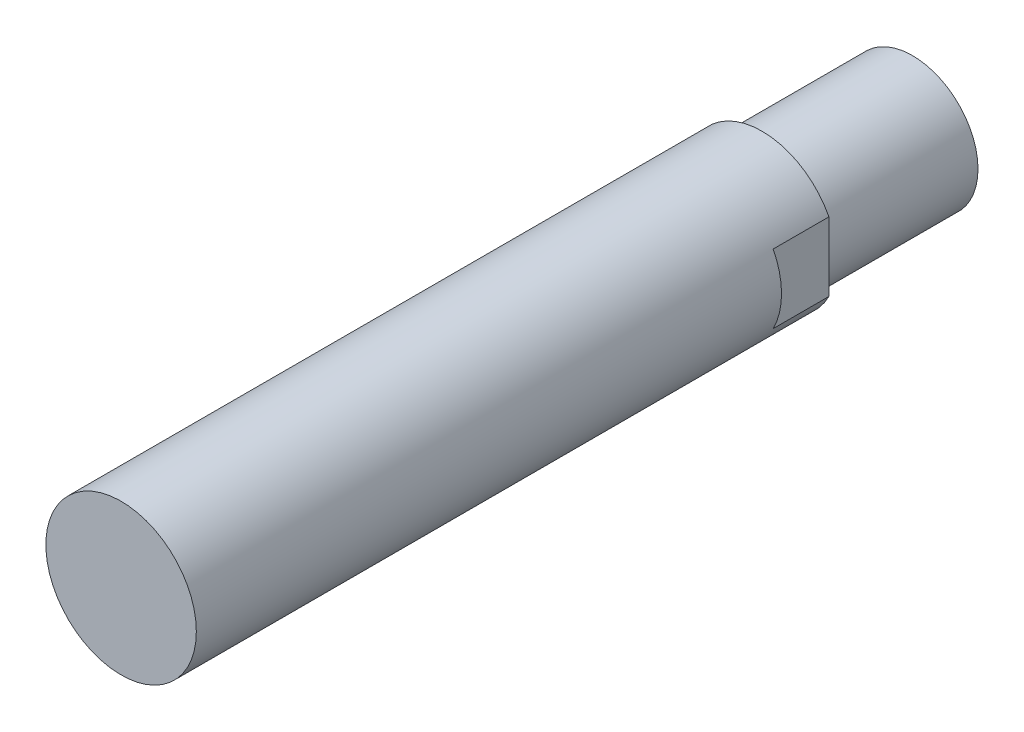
ISO-10303-21;
HEADER;
FILE_DESCRIPTION(('STEP AP214'),'2;1');
FILE_NAME('part.step','',(''),(''),'','','');
FILE_SCHEMA(('AUTOMOTIVE_DESIGN { 1 0 10303 214 1 1 1 1 }'));
ENDSEC;
DATA;
#1=APPLICATION_CONTEXT('core data for automotive mechanical design processes');
#2=APPLICATION_PROTOCOL_DEFINITION('international standard','automotive_design',2000,#1);
#3=PRODUCT_CONTEXT('',#1,'mechanical');
#4=PRODUCT('Part','Part','',(#3));
#5=PRODUCT_RELATED_PRODUCT_CATEGORY('part','',(#4));
#6=PRODUCT_DEFINITION_FORMATION('','',#4);
#7=PRODUCT_DEFINITION_CONTEXT('part definition',#1,'design');
#8=PRODUCT_DEFINITION('design','',#6,#7);
#9=PRODUCT_DEFINITION_SHAPE('','',#8);
#10=(LENGTH_UNIT() NAMED_UNIT(*) SI_UNIT(.MILLI.,.METRE.));
#11=(NAMED_UNIT(*) PLANE_ANGLE_UNIT() SI_UNIT($,.RADIAN.));
#12=(NAMED_UNIT(*) SI_UNIT($,.STERADIAN.) SOLID_ANGLE_UNIT());
#13=UNCERTAINTY_MEASURE_WITH_UNIT(LENGTH_MEASURE(1.E-05),#10,'distance_accuracy_value','');
#14=(GEOMETRIC_REPRESENTATION_CONTEXT(3) GLOBAL_UNCERTAINTY_ASSIGNED_CONTEXT((#13)) GLOBAL_UNIT_ASSIGNED_CONTEXT((#10,
#11,#12)) REPRESENTATION_CONTEXT('',''));
#15=CARTESIAN_POINT('',(0.,0.,0.));
#16=DIRECTION('',(0.,0.,1.));
#17=DIRECTION('',(1.,0.,0.));
#18=AXIS2_PLACEMENT_3D('',#15,#16,#17);
#19=CARTESIAN_POINT('',(0.,1.88737914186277E-12,-142.));
#20=DIRECTION('',(0.,0.,0.999999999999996));
#21=DIRECTION('',(1.,0.,0.));
#22=AXIS2_PLACEMENT_3D('',#19,#20,#21);
#23=CYLINDRICAL_SURFACE('',#22,13.5);
#24=CARTESIAN_POINT('',(8.88178419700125E-13,0.,-115.));
#25=DIRECTION('',(0.,0.,0.999999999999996));
#26=DIRECTION('',(1.,0.,0.));
#27=AXIS2_PLACEMENT_3D('',#24,#25,#26);
#28=CIRCLE('',#27,13.5);
#29=CARTESIAN_POINT('',(12.0000000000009,-6.18465843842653,-115.));
#30=VERTEX_POINT('',#29);
#31=CARTESIAN_POINT('',(-11.9999999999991,-6.18465843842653,-115.));
#32=VERTEX_POINT('',#31);
#33=EDGE_CURVE('E63',#30,#32,#28,.F.);
#34=ORIENTED_EDGE('',*,*,#33,.F.);
#35=DIRECTION('',(0.,0.,0.999999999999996));
#36=VECTOR('',#35,1.);
#37=CARTESIAN_POINT('',(12.,-6.18465843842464,-142.));
#38=LINE('',#37,#36);
#39=CARTESIAN_POINT('',(12.,-6.18465843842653,-105.));
#40=VERTEX_POINT('',#39);
#41=EDGE_CURVE('E127',#40,#30,#38,.F.);
#42=ORIENTED_EDGE('',*,*,#41,.F.);
#43=CARTESIAN_POINT('',(0.,0.,-105.));
#44=DIRECTION('',(0.,0.,0.999999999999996));
#45=DIRECTION('',(1.,0.,0.));
#46=AXIS2_PLACEMENT_3D('',#43,#44,#45);
#47=CIRCLE('',#46,13.5);
#48=CARTESIAN_POINT('',(12.,6.18465843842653,-105.));
#49=VERTEX_POINT('',#48);
#50=EDGE_CURVE('E124',#49,#40,#47,.F.);
#51=ORIENTED_EDGE('',*,*,#50,.F.);
#52=DIRECTION('',(0.,0.,0.999999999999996));
#53=VECTOR('',#52,1.);
#54=CARTESIAN_POINT('',(12.,6.18465843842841,-142.));
#55=LINE('',#54,#53);
#56=CARTESIAN_POINT('',(12.0000000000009,6.18465843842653,-115.));
#57=VERTEX_POINT('',#56);
#58=EDGE_CURVE('E102',#57,#49,#55,.T.);
#59=ORIENTED_EDGE('',*,*,#58,.F.);
#60=CARTESIAN_POINT('',(-11.9999999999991,6.18465843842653,-115.));
#61=VERTEX_POINT('',#60);
#62=EDGE_CURVE('E91',#61,#57,#28,.F.);
#63=ORIENTED_EDGE('',*,*,#62,.F.);
#64=DIRECTION('',(0.,0.,0.999999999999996));
#65=VECTOR('',#64,1.);
#66=CARTESIAN_POINT('',(-12.,6.18465843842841,-141.999999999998));
#67=LINE('',#66,#65);
#68=CARTESIAN_POINT('',(-12.,6.18465843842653,-105.));
#69=VERTEX_POINT('',#68);
#70=EDGE_CURVE('E12',#69,#61,#67,.F.);
#71=ORIENTED_EDGE('',*,*,#70,.F.);
#72=CARTESIAN_POINT('',(-12.,-6.18465843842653,-105.));
#73=VERTEX_POINT('',#72);
#74=EDGE_CURVE('E56',#73,#69,#47,.F.);
#75=ORIENTED_EDGE('',*,*,#74,.F.);
#76=DIRECTION('',(0.,0.,0.999999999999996));
#77=VECTOR('',#76,1.);
#78=CARTESIAN_POINT('',(-12.,-6.18465843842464,-141.999999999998));
#79=LINE('',#78,#77);
#80=EDGE_CURVE('E70',#32,#73,#79,.T.);
#81=ORIENTED_EDGE('',*,*,#80,.F.);
#82=EDGE_LOOP('',(#34,#42,#51,#59,#63,#71,#75,#81));
#83=FACE_BOUND('',#82,.T.);
#84=CARTESIAN_POINT('',(0.,0.,0.));
#85=DIRECTION('',(0.,0.,0.999999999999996));
#86=DIRECTION('',(1.,0.,0.));
#87=AXIS2_PLACEMENT_3D('',#84,#85,#86);
#88=CIRCLE('',#87,13.5);
#89=CARTESIAN_POINT('',(13.5,0.,0.));
#90=VERTEX_POINT('',#89);
#91=EDGE_CURVE('E115',#90,#90,#88,.T.);
#92=ORIENTED_EDGE('',*,*,#91,.F.);
#93=EDGE_LOOP('',(#92));
#94=FACE_BOUND('',#93,.T.);
#95=ADVANCED_FACE('F48',(#83,#94),#23,.T.);
#96=CARTESIAN_POINT('',(0.,0.,0.));
#97=DIRECTION('',(0.,0.,0.999999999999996));
#98=DIRECTION('',(1.,0.,0.));
#99=AXIS2_PLACEMENT_3D('',#96,#97,#98);
#100=PLANE('',#99);
#101=ORIENTED_EDGE('',*,*,#91,.T.);
#102=EDGE_LOOP('',(#101));
#103=FACE_BOUND('',#102,.T.);
#104=ADVANCED_FACE('F147',(#103),#100,.T.);
#105=CARTESIAN_POINT('',(12.,-13.5000000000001,-105.));
#106=DIRECTION('',(-1.,0.,0.));
#107=DIRECTION('',(0.,0.,0.999999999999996));
#108=AXIS2_PLACEMENT_3D('',#105,#106,#107);
#109=PLANE('',#108);
#110=ORIENTED_EDGE('',*,*,#41,.T.);
#111=DIRECTION('',(0.,1.,0.));
#112=VECTOR('',#111,1.);
#113=CARTESIAN_POINT('',(12.0000000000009,-13.5000000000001,-115.));
#114=LINE('',#113,#112);
#115=EDGE_CURVE('E94',#30,#57,#114,.T.);
#116=ORIENTED_EDGE('',*,*,#115,.T.);
#117=ORIENTED_EDGE('',*,*,#58,.T.);
#118=DIRECTION('',(0.,1.,0.));
#119=VECTOR('',#118,1.);
#120=CARTESIAN_POINT('',(12.,-13.5000000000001,-105.));
#121=LINE('',#120,#119);
#122=EDGE_CURVE('E110',#40,#49,#121,.T.);
#123=ORIENTED_EDGE('',*,*,#122,.F.);
#124=EDGE_LOOP('',(#110,#116,#117,#123));
#125=FACE_BOUND('',#124,.T.);
#126=ADVANCED_FACE('F138',(#125),#109,.F.);
#127=CARTESIAN_POINT('',(0.,0.,-105.));
#128=DIRECTION('',(0.,0.,0.999999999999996));
#129=DIRECTION('',(1.,0.,0.));
#130=AXIS2_PLACEMENT_3D('',#127,#128,#129);
#131=PLANE('',#130);
#132=ORIENTED_EDGE('',*,*,#50,.T.);
#133=ORIENTED_EDGE('',*,*,#122,.T.);
#134=EDGE_LOOP('',(#132,#133));
#135=FACE_BOUND('',#134,.T.);
#136=ADVANCED_FACE('F140',(#135),#131,.F.);
#137=ORIENTED_EDGE('',*,*,#74,.T.);
#138=DIRECTION('',(0.,-1.,0.));
#139=VECTOR('',#138,1.);
#140=CARTESIAN_POINT('',(-12.,-13.5000000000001,-105.));
#141=LINE('',#140,#139);
#142=EDGE_CURVE('E107',#69,#73,#141,.T.);
#143=ORIENTED_EDGE('',*,*,#142,.T.);
#144=EDGE_LOOP('',(#137,#143));
#145=FACE_BOUND('',#144,.T.);
#146=ADVANCED_FACE('F133',(#145),#131,.F.);
#147=CARTESIAN_POINT('',(-12.,-13.5000000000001,-105.));
#148=DIRECTION('',(1.,0.,0.));
#149=DIRECTION('',(0.,0.,-0.999999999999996));
#150=AXIS2_PLACEMENT_3D('',#147,#148,#149);
#151=PLANE('',#150);
#152=ORIENTED_EDGE('',*,*,#70,.T.);
#153=DIRECTION('',(0.,-1.,0.));
#154=VECTOR('',#153,1.);
#155=CARTESIAN_POINT('',(-11.9999999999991,-13.5000000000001,-115.));
#156=LINE('',#155,#154);
#157=EDGE_CURVE('E87',#61,#32,#156,.T.);
#158=ORIENTED_EDGE('',*,*,#157,.T.);
#159=ORIENTED_EDGE('',*,*,#80,.T.);
#160=ORIENTED_EDGE('',*,*,#142,.F.);
#161=EDGE_LOOP('',(#152,#158,#159,#160));
#162=FACE_BOUND('',#161,.T.);
#163=ADVANCED_FACE('F106',(#162),#151,.F.);
#164=CARTESIAN_POINT('',(8.88178419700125E-13,0.,-115.));
#165=DIRECTION('',(0.,0.,0.999999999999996));
#166=DIRECTION('',(1.,0.,0.));
#167=AXIS2_PLACEMENT_3D('',#164,#165,#166);
#168=PLANE('',#167);
#169=ORIENTED_EDGE('',*,*,#33,.T.);
#170=ORIENTED_EDGE('',*,*,#157,.F.);
#171=ORIENTED_EDGE('',*,*,#62,.T.);
#172=ORIENTED_EDGE('',*,*,#115,.F.);
#173=EDGE_LOOP('',(#169,#170,#171,#172));
#174=FACE_BOUND('',#173,.T.);
#175=CARTESIAN_POINT('',(8.88178419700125E-13,0.,-115.));
#176=DIRECTION('',(0.,0.,0.999999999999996));
#177=DIRECTION('',(1.,0.,0.));
#178=AXIS2_PLACEMENT_3D('',#175,#176,#177);
#179=CIRCLE('',#178,11.75);
#180=CARTESIAN_POINT('',(11.75,1.88737914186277E-12,-115.));
#181=VERTEX_POINT('',#180);
#182=EDGE_CURVE('E169',#181,#181,#179,.T.);
#183=ORIENTED_EDGE('',*,*,#182,.T.);
#184=EDGE_LOOP('',(#183));
#185=FACE_BOUND('',#184,.T.);
#186=ADVANCED_FACE('F89',(#174,#185),#168,.F.);
#187=CARTESIAN_POINT('',(0.,1.88737914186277E-12,-142.));
#188=DIRECTION('',(0.,0.,0.999999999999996));
#189=DIRECTION('',(1.,0.,0.));
#190=AXIS2_PLACEMENT_3D('',#187,#188,#189);
#191=CYLINDRICAL_SURFACE('',#190,11.75);
#192=CARTESIAN_POINT('',(0.,1.88737914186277E-12,-142.));
#193=DIRECTION('',(0.,0.,0.999999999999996));
#194=DIRECTION('',(1.,0.,0.));
#195=AXIS2_PLACEMENT_3D('',#192,#193,#194);
#196=CIRCLE('',#195,11.75);
#197=CARTESIAN_POINT('',(11.75,1.88737914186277E-12,-142.));
#198=VERTEX_POINT('',#197);
#199=EDGE_CURVE('E104',#198,#198,#196,.T.);
#200=CARTESIAN_POINT('',(11.75,1.88737914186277E-12,-142.));
#201=CARTESIAN_POINT('',(11.75,1.88737914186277E-12,-141.71875));
#202=CARTESIAN_POINT('',(11.75,1.88737914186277E-12,-141.4375));
#203=CARTESIAN_POINT('',(11.75,1.88737914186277E-12,-140.875));
#204=CARTESIAN_POINT('',(11.75,1.88737914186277E-12,-140.59375));
#205=CARTESIAN_POINT('',(11.75,1.88737914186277E-12,-140.03125));
#206=CARTESIAN_POINT('',(11.75,1.88737914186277E-12,-139.75));
#207=CARTESIAN_POINT('',(11.75,1.88737914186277E-12,-139.1875));
#208=CARTESIAN_POINT('',(11.75,1.88737914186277E-12,-138.90625));
#209=CARTESIAN_POINT('',(11.75,1.88737914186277E-12,-138.34375));
#210=CARTESIAN_POINT('',(11.75,1.88737914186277E-12,-138.0625));
#211=CARTESIAN_POINT('',(11.75,1.88737914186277E-12,-137.5));
#212=CARTESIAN_POINT('',(11.75,1.88737914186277E-12,-137.21875));
#213=CARTESIAN_POINT('',(11.75,1.88737914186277E-12,-136.65625));
#214=CARTESIAN_POINT('',(11.75,1.88737914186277E-12,-136.375));
#215=CARTESIAN_POINT('',(11.75,1.88737914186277E-12,-135.8125));
#216=CARTESIAN_POINT('',(11.75,1.88737914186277E-12,-135.53125));
#217=CARTESIAN_POINT('',(11.75,1.88737914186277E-12,-134.96875));
#218=CARTESIAN_POINT('',(11.75,1.88737914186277E-12,-134.6875));
#219=CARTESIAN_POINT('',(11.75,1.88737914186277E-12,-134.125));
#220=CARTESIAN_POINT('',(11.75,1.88737914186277E-12,-133.84375));
#221=CARTESIAN_POINT('',(11.75,1.88737914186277E-12,-133.28125));
#222=CARTESIAN_POINT('',(11.75,1.88737914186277E-12,-133.));
#223=CARTESIAN_POINT('',(11.75,1.88737914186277E-12,-132.4375));
#224=CARTESIAN_POINT('',(11.75,1.88737914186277E-12,-132.15625));
#225=CARTESIAN_POINT('',(11.75,1.88737914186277E-12,-131.59375));
#226=CARTESIAN_POINT('',(11.75,1.88737914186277E-12,-131.3125));
#227=CARTESIAN_POINT('',(11.75,1.88737914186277E-12,-130.75));
#228=CARTESIAN_POINT('',(11.75,1.88737914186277E-12,-130.46875));
#229=CARTESIAN_POINT('',(11.75,1.88737914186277E-12,-129.90625));
#230=CARTESIAN_POINT('',(11.75,1.88737914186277E-12,-129.625));
#231=CARTESIAN_POINT('',(11.75,1.88737914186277E-12,-129.0625));
#232=CARTESIAN_POINT('',(11.75,1.88737914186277E-12,-128.78125));
#233=CARTESIAN_POINT('',(11.75,1.88737914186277E-12,-128.21875));
#234=CARTESIAN_POINT('',(11.75,1.88737914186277E-12,-127.9375));
#235=CARTESIAN_POINT('',(11.75,1.88737914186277E-12,-127.375));
#236=CARTESIAN_POINT('',(11.75,1.88737914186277E-12,-127.09375));
#237=CARTESIAN_POINT('',(11.75,1.88737914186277E-12,-126.53125));
#238=CARTESIAN_POINT('',(11.75,1.88737914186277E-12,-126.25));
#239=CARTESIAN_POINT('',(11.75,1.88737914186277E-12,-125.6875));
#240=CARTESIAN_POINT('',(11.75,1.88737914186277E-12,-125.40625));
#241=CARTESIAN_POINT('',(11.75,1.88737914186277E-12,-124.84375));
#242=CARTESIAN_POINT('',(11.75,1.88737914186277E-12,-124.5625));
#243=CARTESIAN_POINT('',(11.75,1.88737914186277E-12,-124.));
#244=CARTESIAN_POINT('',(11.75,1.88737914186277E-12,-123.71875));
#245=CARTESIAN_POINT('',(11.75,1.88737914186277E-12,-123.15625));
#246=CARTESIAN_POINT('',(11.75,1.88737914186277E-12,-122.875));
#247=CARTESIAN_POINT('',(11.75,1.88737914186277E-12,-122.3125));
#248=CARTESIAN_POINT('',(11.75,1.88737914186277E-12,-122.03125));
#249=CARTESIAN_POINT('',(11.75,1.88737914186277E-12,-121.46875));
#250=CARTESIAN_POINT('',(11.75,1.88737914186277E-12,-121.1875));
#251=CARTESIAN_POINT('',(11.75,1.88737914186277E-12,-120.625));
#252=CARTESIAN_POINT('',(11.75,1.88737914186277E-12,-120.34375));
#253=CARTESIAN_POINT('',(11.75,1.88737914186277E-12,-119.78125));
#254=CARTESIAN_POINT('',(11.75,1.88737914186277E-12,-119.5));
#255=CARTESIAN_POINT('',(11.75,1.88737914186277E-12,-118.9375));
#256=CARTESIAN_POINT('',(11.75,1.88737914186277E-12,-118.65625));
#257=CARTESIAN_POINT('',(11.75,1.88737914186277E-12,-118.09375));
#258=CARTESIAN_POINT('',(11.75,1.88737914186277E-12,-117.8125));
#259=CARTESIAN_POINT('',(11.75,1.88737914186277E-12,-117.25));
#260=CARTESIAN_POINT('',(11.75,1.88737914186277E-12,-116.96875));
#261=CARTESIAN_POINT('',(11.75,1.88737914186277E-12,-116.40625));
#262=CARTESIAN_POINT('',(11.75,1.88737914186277E-12,-116.125));
#263=CARTESIAN_POINT('',(11.75,1.88737914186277E-12,-115.5625));
#264=CARTESIAN_POINT('',(11.75,1.88737914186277E-12,-115.28125));
#265=CARTESIAN_POINT('',(11.75,1.88737914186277E-12,-115.));
#266=B_SPLINE_CURVE_WITH_KNOTS('',3,(#200,#201,#202,#203,#204,#205,#206,#207,#208,#209,#210,
#211,#212,#213,#214,#215,#216,#217,#218,#219,#220,#221,#222,#223,#224,#225,#226,#227,#228,#229,
#230,#231,#232,#233,#234,#235,#236,#237,#238,#239,#240,#241,#242,#243,#244,#245,#246,#247,#248,
#249,#250,#251,#252,#253,#254,#255,#256,#257,#258,#259,#260,#261,#262,#263,#264,#265),
.UNSPECIFIED.,.F.,.F.,(4,2,2,2,2,2,2,2,2,2,2,2,2,2,2,2,2,2,2,2,2,2,2,2,2,2,2,2,2,2,2,2,4),(0.,
0.843749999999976,1.68749999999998,2.53124999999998,3.37499999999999,4.21875000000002,5.0625,
5.90625,6.75000000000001,7.59375000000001,8.43750000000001,9.28125000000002,10.125,10.96875,
11.8125,12.65625,13.5,14.34375,15.1875,16.0312500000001,16.8750000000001,17.7187500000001,
18.5625000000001,19.4062500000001,20.2500000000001,21.0937500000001,21.9375000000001,
22.7812500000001,23.6250000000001,24.4687500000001,25.3125000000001,26.1562500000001,
27.0000000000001),.UNSPECIFIED.);
#267=EDGE_CURVE('BSEAM159',#198,#181,#266,.T.);
#268=ORIENTED_EDGE('',*,*,#199,.T.);
#269=ORIENTED_EDGE('',*,*,#182,.F.);
#270=ORIENTED_EDGE('',*,*,#267,.T.);
#271=ORIENTED_EDGE('',*,*,#267,.F.);
#272=EDGE_LOOP('',(#268,#270,#269,#271));
#273=FACE_BOUND('',#272,.T.);
#274=ADVANCED_FACE('F159',(#273),#191,.T.);
#275=CARTESIAN_POINT('',(0.,1.88737914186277E-12,-142.));
#276=DIRECTION('',(0.,0.,0.999999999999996));
#277=DIRECTION('',(1.,0.,0.));
#278=AXIS2_PLACEMENT_3D('',#275,#276,#277);
#279=PLANE('',#278);
#280=ORIENTED_EDGE('',*,*,#199,.F.);
#281=EDGE_LOOP('',(#280));
#282=FACE_BOUND('',#281,.T.);
#283=ADVANCED_FACE('F157',(#282),#279,.F.);
#284=CLOSED_SHELL('',(#95,#104,#126,#136,#146,#163,#186,#274,#283));
#285=MANIFOLD_SOLID_BREP('B2',#284);
#286=ADVANCED_BREP_SHAPE_REPRESENTATION('',(#18,#285),#14);
#287=SHAPE_DEFINITION_REPRESENTATION(#9,#286);
ENDSEC;
END-ISO-10303-21;
